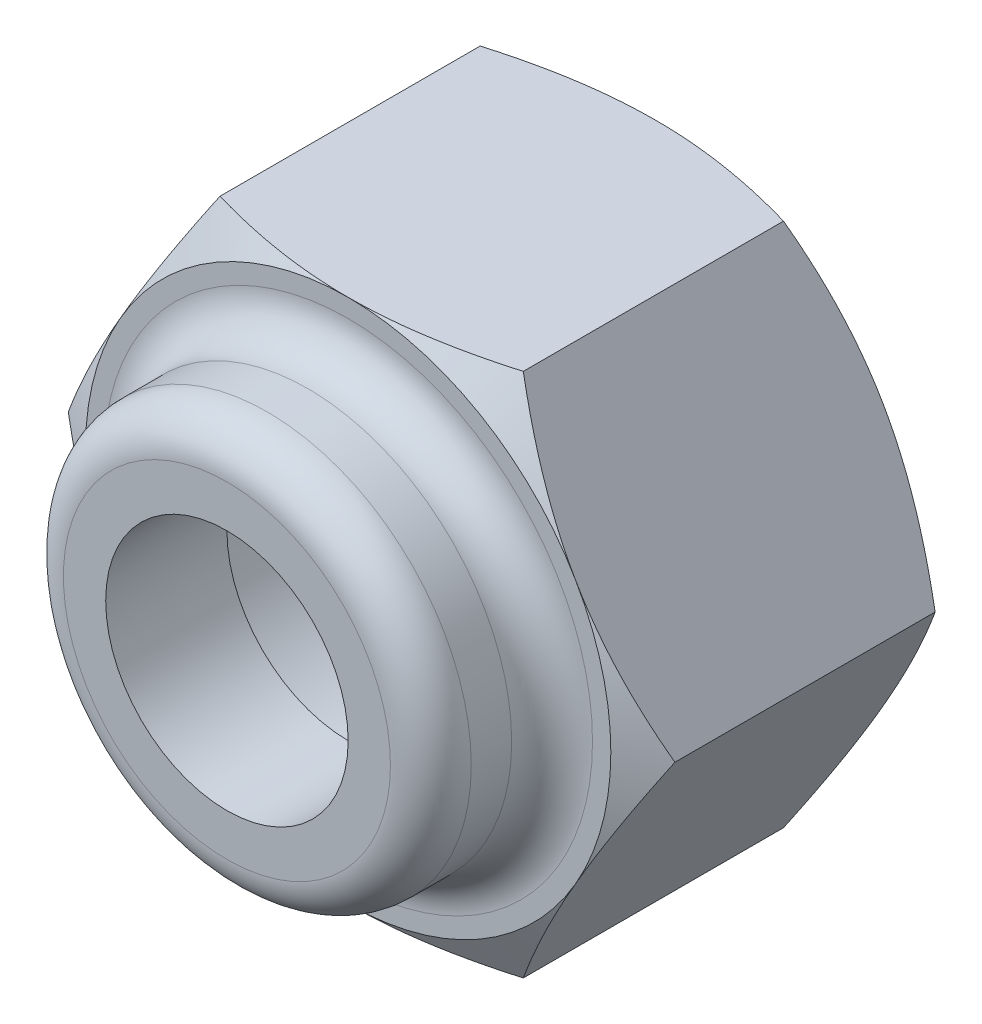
ISO-10303-21;
HEADER;
FILE_DESCRIPTION(('STEP AP214'),'2;1');
FILE_NAME('part.step','',(''),(''),'','','');
FILE_SCHEMA(('AUTOMOTIVE_DESIGN { 1 0 10303 214 1 1 1 1 }'));
ENDSEC;
DATA;
#1=APPLICATION_CONTEXT('core data for automotive mechanical design processes');
#2=APPLICATION_PROTOCOL_DEFINITION('international standard','automotive_design',2000,#1);
#3=PRODUCT_CONTEXT('',#1,'mechanical');
#4=PRODUCT('Part','Part','',(#3));
#5=PRODUCT_RELATED_PRODUCT_CATEGORY('part','',(#4));
#6=PRODUCT_DEFINITION_FORMATION('','',#4);
#7=PRODUCT_DEFINITION_CONTEXT('part definition',#1,'design');
#8=PRODUCT_DEFINITION('design','',#6,#7);
#9=PRODUCT_DEFINITION_SHAPE('','',#8);
#10=(LENGTH_UNIT() NAMED_UNIT(*) SI_UNIT(.MILLI.,.METRE.));
#11=(NAMED_UNIT(*) PLANE_ANGLE_UNIT() SI_UNIT($,.RADIAN.));
#12=(NAMED_UNIT(*) SI_UNIT($,.STERADIAN.) SOLID_ANGLE_UNIT());
#13=UNCERTAINTY_MEASURE_WITH_UNIT(LENGTH_MEASURE(1.E-05),#10,'distance_accuracy_value','');
#14=(GEOMETRIC_REPRESENTATION_CONTEXT(3) GLOBAL_UNCERTAINTY_ASSIGNED_CONTEXT((#13)) GLOBAL_UNIT_ASSIGNED_CONTEXT((#10,
#11,#12)) REPRESENTATION_CONTEXT('',''));
#15=CARTESIAN_POINT('',(0.,0.,0.));
#16=DIRECTION('',(0.,0.,1.));
#17=DIRECTION('',(1.,0.,0.));
#18=AXIS2_PLACEMENT_3D('',#15,#16,#17);
#19=CARTESIAN_POINT('',(-11.2583302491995,-6.49999999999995,7.60000000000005));
#20=DIRECTION('',(0.,0.,1.));
#21=DIRECTION('',(1.,0.,0.));
#22=AXIS2_PLACEMENT_3D('',#19,#20,#21);
#23=PLANE('',#22);
#24=CARTESIAN_POINT('',(0.,0.,7.60000000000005));
#25=DIRECTION('',(0.,0.,1.));
#26=DIRECTION('',(1.,0.,0.));
#27=AXIS2_PLACEMENT_3D('',#24,#25,#26);
#28=CIRCLE('',#27,6.04612896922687);
#29=CARTESIAN_POINT('',(6.04612896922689,0.,7.60000000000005));
#30=VERTEX_POINT('',#29);
#31=EDGE_CURVE('E11',#30,#30,#28,.F.);
#32=ORIENTED_EDGE('',*,*,#31,.T.);
#33=EDGE_LOOP('',(#32));
#34=FACE_BOUND('',#33,.T.);
#35=CARTESIAN_POINT('',(0.,0.,7.60000000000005));
#36=DIRECTION('',(0.,0.,1.));
#37=DIRECTION('',(1.,0.,0.));
#38=AXIS2_PLACEMENT_3D('',#35,#36,#37);
#39=CIRCLE('',#38,6.5);
#40=CARTESIAN_POINT('',(5.62916512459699,-3.25000000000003,7.60000000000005));
#41=VERTEX_POINT('',#40);
#42=CARTESIAN_POINT('',(5.62916512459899,3.25000000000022,7.60000000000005));
#43=VERTEX_POINT('',#42);
#44=EDGE_CURVE('E138',#41,#43,#39,.T.);
#45=ORIENTED_EDGE('',*,*,#44,.T.);
#46=CARTESIAN_POINT('',(0.,0.,7.60000000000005));
#47=DIRECTION('',(0.,0.,1.));
#48=DIRECTION('',(1.,0.,0.));
#49=AXIS2_PLACEMENT_3D('',#46,#47,#48);
#50=CIRCLE('',#49,6.5);
#51=CARTESIAN_POINT('',(0.,6.50000000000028,7.60000000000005));
#52=VERTEX_POINT('',#51);
#53=EDGE_CURVE('E47',#43,#52,#50,.T.);
#54=ORIENTED_EDGE('',*,*,#53,.T.);
#55=CARTESIAN_POINT('',(-5.62916512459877,3.25,7.60000000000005));
#56=VERTEX_POINT('',#55);
#57=EDGE_CURVE('E127',#52,#56,#39,.T.);
#58=ORIENTED_EDGE('',*,*,#57,.T.);
#59=CARTESIAN_POINT('',(-5.62916512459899,-3.24999999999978,7.60000000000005));
#60=VERTEX_POINT('',#59);
#61=EDGE_CURVE('E136',#56,#60,#39,.T.);
#62=ORIENTED_EDGE('',*,*,#61,.T.);
#63=CARTESIAN_POINT('',(0.,-6.50000000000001,7.60000000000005));
#64=VERTEX_POINT('',#63);
#65=EDGE_CURVE('E404',#60,#64,#39,.T.);
#66=ORIENTED_EDGE('',*,*,#65,.T.);
#67=EDGE_CURVE('E252',#64,#41,#39,.T.);
#68=ORIENTED_EDGE('',*,*,#67,.T.);
#69=EDGE_LOOP('',(#45,#54,#58,#62,#66,#68));
#70=FACE_BOUND('',#69,.T.);
#71=ADVANCED_FACE('F31',(#34,#70),#23,.T.);
#72=CARTESIAN_POINT('',(-7.50555349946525,0.,7.60000000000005));
#73=DIRECTION('',(-0.866025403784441,0.500000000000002,0.));
#74=DIRECTION('',(-0.500000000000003,-0.866025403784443,0.));
#75=AXIS2_PLACEMENT_3D('',#72,#73,#74);
#76=PLANE('',#75);
#77=DIRECTION('',(0.,0.,-1.));
#78=VECTOR('',#77,1.);
#79=CARTESIAN_POINT('',(-7.50555349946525,0.,7.60000000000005));
#80=LINE('',#79,#78);
#81=CARTESIAN_POINT('',(-7.50555349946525,0.,7.01944341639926));
#82=VERTEX_POINT('',#81);
#83=CARTESIAN_POINT('',(-7.50555349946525,0.,0.580556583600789));
#84=VERTEX_POINT('',#83);
#85=EDGE_CURVE('E235',#82,#84,#80,.T.);
#86=ORIENTED_EDGE('',*,*,#85,.F.);
#87=CARTESIAN_POINT('',(-7.50566896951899,-0.000199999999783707,7.01937674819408));
#88=CARTESIAN_POINT('',(-7.42317863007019,0.142677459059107,7.06699557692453));
#89=CARTESIAN_POINT('',(-7.34038072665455,0.286087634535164,7.11245329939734));
#90=CARTESIAN_POINT('',(-7.17411251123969,0.574072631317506,7.19845131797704));
#91=CARTESIAN_POINT('',(-7.09064192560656,0.718647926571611,7.23898949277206));
#92=CARTESIAN_POINT('',(-6.83889369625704,1.15468865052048,7.35242899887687));
#93=CARTESIAN_POINT('',(-6.66962231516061,1.44787528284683,7.41695219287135));
#94=CARTESIAN_POINT('',(-6.41631077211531,1.88662374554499,7.49261341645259));
#95=CARTESIAN_POINT('',(-6.3330274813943,2.03087463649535,7.51416714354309));
#96=CARTESIAN_POINT('',(-6.16608458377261,2.32002821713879,7.55030968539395));
#97=CARTESIAN_POINT('',(-6.08242501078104,2.46493084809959,7.56489911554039));
#98=CARTESIAN_POINT('',(-5.91496056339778,2.75498777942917,7.58674124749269));
#99=CARTESIAN_POINT('',(-5.8311559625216,2.9001416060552,7.59400227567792));
#100=CARTESIAN_POINT('',(-5.66347396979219,3.19057533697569,7.60103969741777));
#101=CARTESIAN_POINT('',(-5.57959658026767,3.33585523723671,7.60081632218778));
#102=CARTESIAN_POINT('',(-5.34979921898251,3.73387594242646,7.58991654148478));
#103=CARTESIAN_POINT('',(-5.20395446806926,3.98648646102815,7.57161818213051));
#104=CARTESIAN_POINT('',(-4.91323365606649,4.49002967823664,7.51359365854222));
#105=CARTESIAN_POINT('',(-4.76835861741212,4.7409606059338,7.47384766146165));
#106=CARTESIAN_POINT('',(-4.477052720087,5.24551722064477,7.37449409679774));
#107=CARTESIAN_POINT('',(-4.33065861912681,5.49907924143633,7.31446557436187));
#108=CARTESIAN_POINT('',(-4.04005357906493,6.00242193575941,7.17822500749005));
#109=CARTESIAN_POINT('',(-3.89583891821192,6.25220905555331,7.10204496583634));
#110=CARTESIAN_POINT('',(-3.75266127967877,6.50020000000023,7.01937674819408));
#111=B_SPLINE_CURVE_WITH_KNOTS('',3,(#87,#88,#89,#90,#91,#92,#93,#94,#95,#96,#97,#98,#99,#100,
#101,#102,#103,#104,#105,#106,#107,#108,#109,#110),.UNSPECIFIED.,.F.,.F.,(4,2,2,2,2,2,2,2,2,2,2,
4),(0.,0.515105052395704,1.03043143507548,2.06322554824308,2.56697389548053,3.07067772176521,
3.57380860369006,4.07692394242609,4.95279354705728,5.82947446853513,6.72559912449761,
7.61996451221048),.UNSPECIFIED.);
#112=EDGE_CURVE('E283',#82,#56,#111,.T.);
#113=ORIENTED_EDGE('',*,*,#112,.T.);
#114=CARTESIAN_POINT('',(-3.75277674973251,6.50000000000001,7.01944341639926));
#115=VERTEX_POINT('',#114);
#116=EDGE_CURVE('E130',#56,#115,#111,.T.);
#117=ORIENTED_EDGE('',*,*,#116,.T.);
#118=DIRECTION('',(0.,0.,-1.));
#119=VECTOR('',#118,1.);
#120=CARTESIAN_POINT('',(-3.75277674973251,6.50000000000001,7.60000000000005));
#121=LINE('',#120,#119);
#122=CARTESIAN_POINT('',(-3.75277674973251,6.50000000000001,0.580556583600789));
#123=VERTEX_POINT('',#122);
#124=EDGE_CURVE('E147',#115,#123,#121,.T.);
#125=ORIENTED_EDGE('',*,*,#124,.T.);
#126=CARTESIAN_POINT('',(-3.75266127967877,6.50020000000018,0.580623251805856));
#127=CARTESIAN_POINT('',(-3.83515161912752,6.3573225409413,0.533004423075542));
#128=CARTESIAN_POINT('',(-3.91794952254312,6.21391236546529,0.487546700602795));
#129=CARTESIAN_POINT('',(-4.08421773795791,5.92592736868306,0.401548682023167));
#130=CARTESIAN_POINT('',(-4.167688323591,5.78135207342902,0.361010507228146));
#131=CARTESIAN_POINT('',(-4.41943655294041,5.34531134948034,0.247571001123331));
#132=CARTESIAN_POINT('',(-4.58870793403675,5.0521247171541,0.183047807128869));
#133=CARTESIAN_POINT('',(-4.84201947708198,4.61337625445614,0.107386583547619));
#134=CARTESIAN_POINT('',(-4.92530276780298,4.46912536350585,0.0858328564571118));
#135=CARTESIAN_POINT('',(-5.09224566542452,4.17997178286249,0.0496903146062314));
#136=CARTESIAN_POINT('',(-5.17590523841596,4.03506915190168,0.0351008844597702));
#137=CARTESIAN_POINT('',(-5.34336968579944,3.74501222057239,0.0132587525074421));
#138=CARTESIAN_POINT('',(-5.42717428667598,3.59985839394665,0.00599772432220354));
#139=CARTESIAN_POINT('',(-5.59485627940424,3.30942466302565,-0.00103969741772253));
#140=CARTESIAN_POINT('',(-5.67873366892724,3.16414476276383,-0.000816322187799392));
#141=CARTESIAN_POINT('',(-5.9085310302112,2.76612405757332,0.0100834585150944));
#142=CARTESIAN_POINT('',(-6.05437578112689,2.51351353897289,0.0283818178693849));
#143=CARTESIAN_POINT('',(-6.34509659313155,2.00997032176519,0.0864063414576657));
#144=CARTESIAN_POINT('',(-6.48997163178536,1.75903939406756,0.126152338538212));
#145=CARTESIAN_POINT('',(-6.7812775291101,1.25448277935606,0.225505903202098));
#146=CARTESIAN_POINT('',(-6.92767163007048,1.00092075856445,0.285534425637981));
#147=CARTESIAN_POINT('',(-7.21827667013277,0.497578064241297,0.42177499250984));
#148=CARTESIAN_POINT('',(-7.36249133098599,0.247790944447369,0.497955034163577));
#149=CARTESIAN_POINT('',(-7.50566896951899,-0.000199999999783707,0.580623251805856));
#150=B_SPLINE_CURVE_WITH_KNOTS('',3,(#126,#127,#128,#129,#130,#131,#132,#133,#134,#135,#136,
#137,#138,#139,#140,#141,#142,#143,#144,#145,#146,#147,#148,#149),.UNSPECIFIED.,.F.,.F.,(4,2,2,
2,2,2,2,2,2,2,2,4),(0.,0.515105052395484,1.03043143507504,2.06322554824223,2.56697389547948,
3.07067772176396,3.57380860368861,4.07692394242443,4.952793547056,5.82947446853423,
6.72559912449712,7.61996451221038),.UNSPECIFIED.);
#151=CARTESIAN_POINT('',(-5.62916512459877,3.25,0.));
#152=VERTEX_POINT('',#151);
#153=EDGE_CURVE('E231',#123,#152,#150,.T.);
#154=ORIENTED_EDGE('',*,*,#153,.T.);
#155=EDGE_CURVE('E225',#152,#84,#150,.T.);
#156=ORIENTED_EDGE('',*,*,#155,.T.);
#157=EDGE_LOOP('',(#86,#113,#117,#125,#154,#156));
#158=FACE_BOUND('',#157,.T.);
#159=ADVANCED_FACE('F33',(#158),#76,.T.);
#160=CARTESIAN_POINT('',(-3.75277674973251,-6.50000000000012,7.60000000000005));
#161=DIRECTION('',(-0.866025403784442,-0.500000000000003,0.));
#162=DIRECTION('',(0.500000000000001,-0.866025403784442,0.));
#163=AXIS2_PLACEMENT_3D('',#160,#161,#162);
#164=PLANE('',#163);
#165=DIRECTION('',(0.,0.,-1.));
#166=VECTOR('',#165,1.);
#167=CARTESIAN_POINT('',(-3.75277674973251,-6.50000000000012,7.60000000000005));
#168=LINE('',#167,#166);
#169=CARTESIAN_POINT('',(-3.75277674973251,-6.50000000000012,7.01944341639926));
#170=VERTEX_POINT('',#169);
#171=CARTESIAN_POINT('',(-3.75277674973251,-6.50000000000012,0.580556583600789));
#172=VERTEX_POINT('',#171);
#173=EDGE_CURVE('E238',#170,#172,#168,.T.);
#174=ORIENTED_EDGE('',*,*,#173,.F.);
#175=CARTESIAN_POINT('',(-3.75266127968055,-6.50019999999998,7.01937674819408));
#176=CARTESIAN_POINT('',(-3.83515161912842,-6.35732254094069,7.06699557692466));
#177=CARTESIAN_POINT('',(-3.91794952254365,-6.2139123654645,7.1124532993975));
#178=CARTESIAN_POINT('',(-4.08421773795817,-5.92592736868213,7.1984513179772));
#179=CARTESIAN_POINT('',(-4.16768832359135,-5.78135207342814,7.23898949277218));
#180=CARTESIAN_POINT('',(-4.41943655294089,-5.34531134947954,7.35242899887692));
#181=CARTESIAN_POINT('',(-4.58870793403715,-5.05212471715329,7.41695219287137));
#182=CARTESIAN_POINT('',(-4.84201947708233,-4.61337625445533,7.49261341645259));
#183=CARTESIAN_POINT('',(-4.92530276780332,-4.46912536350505,7.51416714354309));
#184=CARTESIAN_POINT('',(-5.09224566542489,-4.17997178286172,7.55030968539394));
#185=CARTESIAN_POINT('',(-5.17590523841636,-4.03506915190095,7.56489911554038));
#186=CARTESIAN_POINT('',(-5.34336968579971,-3.7450122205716,7.5867412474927));
#187=CARTESIAN_POINT('',(-5.42717428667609,-3.59985839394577,7.59400227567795));
#188=CARTESIAN_POINT('',(-5.59485627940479,-3.30942466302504,7.60103969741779));
#189=CARTESIAN_POINT('',(-5.67873366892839,-3.16414476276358,7.60081632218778));
#190=CARTESIAN_POINT('',(-5.90853103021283,-2.7661240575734,7.58991654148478));
#191=CARTESIAN_POINT('',(-6.05437578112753,-2.51351353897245,7.57161818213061));
#192=CARTESIAN_POINT('',(-6.34509659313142,-2.00997032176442,7.51359365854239));
#193=CARTESIAN_POINT('',(-6.48997163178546,-1.75903939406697,7.47384766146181));
#194=CARTESIAN_POINT('',(-6.78127752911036,-1.25448277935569,7.37449409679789));
#195=CARTESIAN_POINT('',(-6.92767163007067,-1.0009207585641,7.31446557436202));
#196=CARTESIAN_POINT('',(-7.21827667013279,-0.497578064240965,7.17822500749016));
#197=CARTESIAN_POINT('',(-7.36249133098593,-0.247790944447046,7.10204496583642));
#198=CARTESIAN_POINT('',(-7.50566896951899,0.000200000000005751,7.01937674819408));
#199=B_SPLINE_CURVE_WITH_KNOTS('',3,(#175,#176,#177,#178,#179,#180,#181,#182,#183,#184,#185,
#186,#187,#188,#189,#190,#191,#192,#193,#194,#195,#196,#197,#198),.UNSPECIFIED.,.F.,.F.,(4,2,2,
2,2,2,2,2,2,2,2,4),(0.,0.515105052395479,1.03043143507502,2.06322554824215,2.56697389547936,
3.07067772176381,3.57380860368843,4.07692394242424,4.95279354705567,5.82947446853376,
6.72559912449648,7.61996451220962),.UNSPECIFIED.);
#200=EDGE_CURVE('E194',#170,#60,#199,.T.);
#201=ORIENTED_EDGE('',*,*,#200,.T.);
#202=EDGE_CURVE('E188',#60,#82,#199,.T.);
#203=ORIENTED_EDGE('',*,*,#202,.T.);
#204=ORIENTED_EDGE('',*,*,#85,.T.);
#205=CARTESIAN_POINT('',(-7.50566896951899,0.000200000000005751,0.580623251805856));
#206=CARTESIAN_POINT('',(-7.4231786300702,-0.142677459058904,0.533004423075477));
#207=CARTESIAN_POINT('',(-7.34038072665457,-0.286087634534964,0.487546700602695));
#208=CARTESIAN_POINT('',(-7.17411251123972,-0.574072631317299,0.401548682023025));
#209=CARTESIAN_POINT('',(-7.0906419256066,-0.718647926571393,0.361010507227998));
#210=CARTESIAN_POINT('',(-6.83889369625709,-1.15468865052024,0.247571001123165));
#211=CARTESIAN_POINT('',(-6.66962231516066,-1.44787528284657,0.18304780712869));
#212=CARTESIAN_POINT('',(-6.41631077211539,-1.88662374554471,0.107386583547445));
#213=CARTESIAN_POINT('',(-6.33302748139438,-2.03087463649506,0.0858328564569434));
#214=CARTESIAN_POINT('',(-6.1660845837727,-2.32002821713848,0.0496903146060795));
#215=CARTESIAN_POINT('',(-6.08242501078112,-2.46493084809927,0.0351008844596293));
#216=CARTESIAN_POINT('',(-5.91496056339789,-2.75498777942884,0.0132587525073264));
#217=CARTESIAN_POINT('',(-5.83115596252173,-2.90014160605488,0.00599772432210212));
#218=CARTESIAN_POINT('',(-5.66347396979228,-3.19057533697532,-0.00103969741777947));
#219=CARTESIAN_POINT('',(-5.57959658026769,-3.33585523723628,-0.000816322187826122));
#220=CARTESIAN_POINT('',(-5.3497992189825,-3.73387594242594,0.0100834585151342));
#221=CARTESIAN_POINT('',(-5.20395446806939,-3.98648646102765,0.0283818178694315));
#222=CARTESIAN_POINT('',(-4.91323365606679,-4.4900296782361,0.0864063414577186));
#223=CARTESIAN_POINT('',(-4.76835861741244,-4.7409606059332,0.126152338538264));
#224=CARTESIAN_POINT('',(-4.47705272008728,-5.24551722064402,0.225505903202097));
#225=CARTESIAN_POINT('',(-4.33065861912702,-5.49907924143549,0.285534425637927));
#226=CARTESIAN_POINT('',(-4.04005357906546,-6.00242193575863,0.421774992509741));
#227=CARTESIAN_POINT('',(-3.89583891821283,-6.25220905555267,0.497955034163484));
#228=CARTESIAN_POINT('',(-3.75266127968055,-6.50019999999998,0.580623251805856));
#229=B_SPLINE_CURVE_WITH_KNOTS('',3,(#205,#206,#207,#208,#209,#210,#211,#212,#213,#214,#215,
#216,#217,#218,#219,#220,#221,#222,#223,#224,#225,#226,#227,#228),.UNSPECIFIED.,.F.,.F.,(4,2,2,
2,2,2,2,2,2,2,2,4),(0.,0.515105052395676,1.03043143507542,2.06322554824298,2.5669738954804,
3.07067772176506,3.57380860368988,4.07692394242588,4.95279354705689,5.82947446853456,
6.72559912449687,7.61996451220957),.UNSPECIFIED.);
#230=CARTESIAN_POINT('',(-5.62916512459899,-3.24999999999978,0.));
#231=VERTEX_POINT('',#230);
#232=EDGE_CURVE('E218',#84,#231,#229,.T.);
#233=ORIENTED_EDGE('',*,*,#232,.T.);
#234=EDGE_CURVE('E211',#231,#172,#229,.T.);
#235=ORIENTED_EDGE('',*,*,#234,.T.);
#236=EDGE_LOOP('',(#174,#201,#203,#204,#233,#235));
#237=FACE_BOUND('',#236,.T.);
#238=ADVANCED_FACE('F201',(#237),#164,.T.);
#239=CARTESIAN_POINT('',(3.75277674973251,-6.49999999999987,7.60000000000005));
#240=DIRECTION('',(0.,-1.,0.));
#241=DIRECTION('',(1.,0.,0.));
#242=AXIS2_PLACEMENT_3D('',#239,#240,#241);
#243=PLANE('',#242);
#244=DIRECTION('',(0.,0.,-1.));
#245=VECTOR('',#244,1.);
#246=CARTESIAN_POINT('',(3.75277674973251,-6.49999999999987,7.60000000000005));
#247=LINE('',#246,#245);
#248=CARTESIAN_POINT('',(3.75277674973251,-6.49999999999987,7.01944341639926));
#249=VERTEX_POINT('',#248);
#250=CARTESIAN_POINT('',(3.75277674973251,-6.49999999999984,0.580556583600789));
#251=VERTEX_POINT('',#250);
#252=EDGE_CURVE('E240',#249,#251,#247,.T.);
#253=ORIENTED_EDGE('',*,*,#252,.F.);
#254=CARTESIAN_POINT('',(-9.9772907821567,-6.49999999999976,4.47778992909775));
#255=CARTESIAN_POINT('',(-9.69424196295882,-6.49999999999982,4.614676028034));
#256=CARTESIAN_POINT('',(-9.41053219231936,-6.49999999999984,4.7502194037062));
#257=CARTESIAN_POINT('',(-8.84143883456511,-6.49999999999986,5.01786337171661));
#258=CARTESIAN_POINT('',(-8.55605498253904,-6.49999999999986,5.14996340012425));
#259=CARTESIAN_POINT('',(-7.98174100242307,-6.49999999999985,5.41065019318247));
#260=CARTESIAN_POINT('',(-7.69279995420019,-6.49999999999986,5.53921298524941));
#261=CARTESIAN_POINT('',(-7.11258334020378,-6.49999999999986,5.79093759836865));
#262=CARTESIAN_POINT('',(-6.82130788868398,-6.49999999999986,5.9140996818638));
#263=CARTESIAN_POINT('',(-6.22696298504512,-6.49999999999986,6.15727415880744));
#264=CARTESIAN_POINT('',(-5.92380598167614,-6.49999999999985,6.27707377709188));
#265=CARTESIAN_POINT('',(-5.31390808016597,-6.49999999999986,6.507353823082));
#266=CARTESIAN_POINT('',(-5.00716677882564,-6.49999999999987,6.6178331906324));
#267=CARTESIAN_POINT('',(-4.39021687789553,-6.49999999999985,6.82649614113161));
#268=CARTESIAN_POINT('',(-4.08001710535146,-6.49999999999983,6.92470553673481));
#269=CARTESIAN_POINT('',(-3.45518117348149,-6.49999999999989,7.10561092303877));
#270=CARTESIAN_POINT('',(-3.1405464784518,-6.49999999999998,7.18831191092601));
#271=CARTESIAN_POINT('',(-2.50833584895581,-6.49999999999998,7.33372427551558));
#272=CARTESIAN_POINT('',(-2.19078462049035,-6.49999999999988,7.39654012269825));
#273=CARTESIAN_POINT('',(-1.71165005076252,-6.49999999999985,7.47308014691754));
#274=CARTESIAN_POINT('',(-1.55145779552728,-6.49999999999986,7.49564728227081));
#275=CARTESIAN_POINT('',(-1.23031334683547,-6.49999999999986,7.53444204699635));
#276=CARTESIAN_POINT('',(-1.0693612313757,-6.49999999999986,7.55067031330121));
#277=CARTESIAN_POINT('',(-0.748968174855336,-6.49999999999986,7.57626594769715));
#278=CARTESIAN_POINT('',(-0.589534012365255,-6.49999999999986,7.5857178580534));
#279=CARTESIAN_POINT('',(-0.270409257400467,-6.49999999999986,7.5978788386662));
#280=CARTESIAN_POINT('',(-0.110718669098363,-6.49999999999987,7.60058801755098));
#281=CARTESIAN_POINT('',(0.208634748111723,-6.49999999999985,7.5991990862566));
#282=CARTESIAN_POINT('',(0.368297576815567,-6.49999999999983,7.59510092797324));
#283=CARTESIAN_POINT('',(0.687311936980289,-6.4999999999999,7.58019557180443));
#284=CARTESIAN_POINT('',(0.846663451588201,-6.49999999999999,7.56938802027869));
#285=CARTESIAN_POINT('',(1.23282228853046,-6.50000000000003,7.53529329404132));
#286=CARTESIAN_POINT('',(1.45933886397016,-6.49999999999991,7.50864596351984));
#287=CARTESIAN_POINT('',(1.91061150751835,-6.49999999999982,7.44327257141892));
#288=CARTESIAN_POINT('',(2.13536731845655,-6.49999999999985,7.40454477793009));
#289=CARTESIAN_POINT('',(2.80678176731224,-6.4999999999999,7.27230120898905));
#290=CARTESIAN_POINT('',(3.25031976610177,-6.49999999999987,7.16275192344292));
#291=CARTESIAN_POINT('',(3.91338278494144,-6.49999999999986,6.97379149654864));
#292=CARTESIAN_POINT('',(4.13637192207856,-6.49999999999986,6.90584530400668));
#293=CARTESIAN_POINT('',(4.58018302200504,-6.49999999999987,6.76314671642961));
#294=CARTESIAN_POINT('',(4.80100497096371,-6.49999999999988,6.68839427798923));
#295=CARTESIAN_POINT('',(5.24055596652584,-6.49999999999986,6.53326153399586));
#296=CARTESIAN_POINT('',(5.45928573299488,-6.49999999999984,6.45288324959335));
#297=CARTESIAN_POINT('',(5.89495024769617,-6.4999999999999,6.28741937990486));
#298=CARTESIAN_POINT('',(6.11188501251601,-6.49999999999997,6.20233383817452));
#299=CARTESIAN_POINT('',(6.60444885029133,-6.49999999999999,6.00396155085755));
#300=CARTESIAN_POINT('',(6.8795745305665,-6.4999999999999,5.88942755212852));
#301=CARTESIAN_POINT('',(7.42764194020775,-6.49999999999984,5.65523525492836));
#302=CARTESIAN_POINT('',(7.7005835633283,-6.49999999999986,5.5355767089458));
#303=CARTESIAN_POINT('',(8.24466177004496,-6.49999999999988,5.29211434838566));
#304=CARTESIAN_POINT('',(8.51579804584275,-6.49999999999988,5.16830984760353));
#305=CARTESIAN_POINT('',(9.05651181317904,-6.49999999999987,4.91733776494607));
#306=CARTESIAN_POINT('',(9.32608927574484,-6.49999999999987,4.79017012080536));
#307=CARTESIAN_POINT('',(10.1333173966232,-6.49999999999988,4.40433583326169));
#308=CARTESIAN_POINT('',(10.6689977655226,-6.49999999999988,4.14154902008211));
#309=CARTESIAN_POINT('',(11.7365775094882,-6.49999999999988,3.6084057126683));
#310=CARTESIAN_POINT('',(12.2684767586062,-6.49999999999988,3.33804896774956));
#311=CARTESIAN_POINT('',(13.0435391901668,-6.49999999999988,2.93906244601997));
#312=CARTESIAN_POINT('',(13.2878118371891,-6.49999999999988,2.81258160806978));
#313=CARTESIAN_POINT('',(13.7758255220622,-6.49999999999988,2.5586084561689));
#314=CARTESIAN_POINT('',(14.0195665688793,-6.49999999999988,2.43111615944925));
#315=CARTESIAN_POINT('',(14.7501146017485,-6.49999999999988,2.04731206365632));
#316=CARTESIAN_POINT('',(15.2362291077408,-6.49999999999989,1.78968202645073));
#317=CARTESIAN_POINT('',(16.2059474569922,-6.49999999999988,1.27229349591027));
#318=CARTESIAN_POINT('',(16.6895544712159,-6.49999999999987,1.01254093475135));
#319=CARTESIAN_POINT('',(17.6555855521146,-6.4999999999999,0.490900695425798));
#320=CARTESIAN_POINT('',(18.1380096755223,-6.49999999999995,0.229013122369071));
#321=CARTESIAN_POINT('',(18.619992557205,-6.50000000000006,-0.0336789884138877));
#322=B_SPLINE_CURVE_WITH_KNOTS('',3,(#254,#255,#256,#257,#258,#259,#260,#261,#262,#263,#264,
#265,#266,#267,#268,#269,#270,#271,#272,#273,#274,#275,#276,#277,#278,#279,#280,#281,#282,#283,
#284,#285,#286,#287,#288,#289,#290,#291,#292,#293,#294,#295,#296,#297,#298,#299,#300,#301,#302,
#303,#304,#305,#306,#307,#308,#309,#310,#311,#312,#313,#314,#315,#316,#317,#318,#319,#320,#321),
.UNSPECIFIED.,.F.,.F.,(4,2,2,2,2,2,2,2,2,2,2,2,2,2,2,2,2,2,2,2,2,2,2,2,2,2,2,2,2,2,2,2,2,4),(0.,
0.943245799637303,1.88664511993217,2.83535686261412,3.78402245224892,4.76181213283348,
5.7397128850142,6.71552046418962,7.69101307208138,8.66129224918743,9.14650857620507,
9.63167613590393,10.1106800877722,10.5896763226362,11.0686759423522,11.547700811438,
12.2315479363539,12.9154931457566,14.2841869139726,14.9834656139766,15.6827487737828,
16.3817819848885,17.0808087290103,17.9747819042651,18.8687983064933,19.7629634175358,
20.6571450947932,22.447043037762,24.2370003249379,25.0622248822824,25.8874354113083,
27.5379151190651,29.1847624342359,30.8315291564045),.UNSPECIFIED.);
#323=EDGE_CURVE('E299',#249,#64,#322,.F.);
#324=ORIENTED_EDGE('',*,*,#323,.T.);
#325=EDGE_CURVE('E195',#64,#170,#322,.F.);
#326=ORIENTED_EDGE('',*,*,#325,.T.);
#327=ORIENTED_EDGE('',*,*,#173,.T.);
#328=CARTESIAN_POINT('',(-9.97058141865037,-6.49999999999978,3.11896475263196));
#329=CARTESIAN_POINT('',(-9.68505665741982,-6.49999999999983,2.98091016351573));
#330=CARTESIAN_POINT('',(-9.39885881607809,-6.49999999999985,2.84422254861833));
#331=CARTESIAN_POINT('',(-8.82475313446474,-6.49999999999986,2.57436199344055));
#332=CARTESIAN_POINT('',(-8.53684501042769,-6.49999999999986,2.44118965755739));
#333=CARTESIAN_POINT('',(-7.9574083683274,-6.49999999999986,2.17844267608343));
#334=CARTESIAN_POINT('',(-7.66586857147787,-6.49999999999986,2.04889281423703));
#335=CARTESIAN_POINT('',(-7.08039928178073,-6.49999999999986,1.79533218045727));
#336=CARTESIAN_POINT('',(-6.78646991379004,-6.49999999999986,1.67132112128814));
#337=CARTESIAN_POINT('',(-6.19202314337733,-6.49999999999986,1.42880427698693));
#338=CARTESIAN_POINT('',(-5.89146936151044,-6.49999999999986,1.31038717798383));
#339=CARTESIAN_POINT('',(-5.28682280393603,-6.49999999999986,1.08278341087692));
#340=CARTESIAN_POINT('',(-4.98272963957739,-6.49999999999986,0.973597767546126));
#341=CARTESIAN_POINT('',(-4.37114030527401,-6.49999999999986,0.767377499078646));
#342=CARTESIAN_POINT('',(-4.06365288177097,-6.49999999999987,0.670317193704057));
#343=CARTESIAN_POINT('',(-3.44430270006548,-6.49999999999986,0.491489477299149));
#344=CARTESIAN_POINT('',(-3.13244135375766,-6.49999999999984,0.409717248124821));
#345=CARTESIAN_POINT('',(-2.50415266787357,-6.49999999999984,0.265421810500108));
#346=CARTESIAN_POINT('',(-2.18772435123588,-6.49999999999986,0.202902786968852));
#347=CARTESIAN_POINT('',(-1.55098857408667,-6.49999999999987,0.101323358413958));
#348=CARTESIAN_POINT('',(-1.23068111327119,-6.49999999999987,0.0622629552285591));
#349=CARTESIAN_POINT('',(-0.749699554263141,-6.49999999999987,0.0237698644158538));
#350=CARTESIAN_POINT('',(-0.589789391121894,-6.49999999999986,0.0142870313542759));
#351=CARTESIAN_POINT('',(-0.269703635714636,-6.49999999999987,0.00209911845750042));
#352=CARTESIAN_POINT('',(-0.109528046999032,-6.49999999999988,-0.000606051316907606));
#353=CARTESIAN_POINT('',(0.210745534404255,-6.49999999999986,0.000833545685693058));
#354=CARTESIAN_POINT('',(0.370843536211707,-6.49999999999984,0.00497636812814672));
#355=CARTESIAN_POINT('',(0.690725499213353,-6.4999999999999,0.0200063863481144));
#356=CARTESIAN_POINT('',(0.850509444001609,-6.49999999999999,0.0308939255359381));
#357=CARTESIAN_POINT('',(1.23721068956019,-6.50000000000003,0.0651780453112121));
#358=CARTESIAN_POINT('',(1.46383600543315,-6.49999999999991,0.0919226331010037));
#359=CARTESIAN_POINT('',(1.9153620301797,-6.49999999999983,0.157500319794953));
#360=CARTESIAN_POINT('',(2.14026225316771,-6.49999999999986,0.196336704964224));
#361=CARTESIAN_POINT('',(2.5881484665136,-6.49999999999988,0.284720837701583));
#362=CARTESIAN_POINT('',(2.81113244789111,-6.49999999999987,0.334278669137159));
#363=CARTESIAN_POINT('',(3.25481181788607,-6.49999999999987,0.442592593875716));
#364=CARTESIAN_POINT('',(3.47550741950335,-6.49999999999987,0.501347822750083));
#365=CARTESIAN_POINT('',(3.92006995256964,-6.49999999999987,0.628192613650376));
#366=CARTESIAN_POINT('',(4.14388106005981,-6.49999999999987,0.696476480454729));
#367=CARTESIAN_POINT('',(4.58913797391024,-6.49999999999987,0.839828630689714));
#368=CARTESIAN_POINT('',(4.81058529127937,-6.49999999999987,0.91489224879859));
#369=CARTESIAN_POINT('',(5.2502263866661,-6.49999999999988,1.07025024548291));
#370=CARTESIAN_POINT('',(5.46843145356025,-6.49999999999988,1.1505128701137));
#371=CARTESIAN_POINT('',(5.90314543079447,-6.49999999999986,1.31577333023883));
#372=CARTESIAN_POINT('',(6.11965362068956,-6.49999999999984,1.40077306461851));
#373=CARTESIAN_POINT('',(6.33537360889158,-6.49999999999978,1.48767357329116));
#374=B_SPLINE_CURVE_WITH_KNOTS('',3,(#328,#329,#330,#331,#332,#333,#334,#335,#336,#337,#338,
#339,#340,#341,#342,#343,#344,#345,#346,#347,#348,#349,#350,#351,#352,#353,#354,#355,#356,#357,
#358,#359,#360,#361,#362,#363,#364,#365,#366,#367,#368,#369,#370,#371,#372,#373),.UNSPECIFIED.,
.F.,.F.,(4,2,2,2,2,2,2,2,2,2,2,2,2,2,2,2,2,2,2,2,2,2,4),(0.,0.95145953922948,1.90308161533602,
2.86011866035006,3.81710601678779,4.78611054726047,5.7552225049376,6.72224587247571,
7.68896396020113,8.65589202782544,9.62282017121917,10.1032714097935,10.5837162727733,
11.0640247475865,11.5443576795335,12.2285708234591,12.9129700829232,13.5980158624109,
14.28299729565,14.9848544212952,15.6862322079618,16.3836698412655,17.081389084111),.UNSPECIFIED.);
#375=CARTESIAN_POINT('',(0.,-6.50000000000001,0.));
#376=VERTEX_POINT('',#375);
#377=EDGE_CURVE('E219',#172,#376,#374,.T.);
#378=ORIENTED_EDGE('',*,*,#377,.T.);
#379=EDGE_CURVE('E220',#376,#251,#374,.T.);
#380=ORIENTED_EDGE('',*,*,#379,.T.);
#381=EDGE_LOOP('',(#253,#324,#326,#327,#378,#380));
#382=FACE_BOUND('',#381,.T.);
#383=ADVANCED_FACE('F205',(#382),#243,.T.);
#384=CARTESIAN_POINT('',(7.50555349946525,2.22044604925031E-13,7.60000000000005));
#385=DIRECTION('',(0.866025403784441,-0.500000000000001,0.));
#386=DIRECTION('',(0.500000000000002,0.866025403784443,0.));
#387=AXIS2_PLACEMENT_3D('',#384,#385,#386);
#388=PLANE('',#387);
#389=DIRECTION('',(0.,0.,-1.));
#390=VECTOR('',#389,1.);
#391=CARTESIAN_POINT('',(7.50555349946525,2.22044604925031E-13,7.60000000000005));
#392=LINE('',#391,#390);
#393=CARTESIAN_POINT('',(7.50555349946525,2.22044604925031E-13,7.01944341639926));
#394=VERTEX_POINT('',#393);
#395=CARTESIAN_POINT('',(7.50555349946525,2.22044604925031E-13,0.580556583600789));
#396=VERTEX_POINT('',#395);
#397=EDGE_CURVE('E242',#394,#396,#392,.T.);
#398=ORIENTED_EDGE('',*,*,#397,.F.);
#399=CARTESIAN_POINT('',(7.50566896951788,0.000200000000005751,7.01937674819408));
#400=CARTESIAN_POINT('',(7.42317863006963,-0.142677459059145,7.06699557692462));
#401=CARTESIAN_POINT('',(7.34038072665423,-0.2860876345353,7.11245329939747));
#402=CARTESIAN_POINT('',(7.17411251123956,-0.574072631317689,7.19845131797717));
#403=CARTESIAN_POINT('',(7.09064192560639,-0.718647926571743,7.23898949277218));
#404=CARTESIAN_POINT('',(6.83889369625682,-1.1546886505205,7.35242899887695));
#405=CARTESIAN_POINT('',(6.66962231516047,-1.44787528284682,7.41695219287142));
#406=CARTESIAN_POINT('',(6.41631077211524,-1.88662374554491,7.49261341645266));
#407=CARTESIAN_POINT('',(6.33302748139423,-2.03087463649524,7.51416714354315));
#408=CARTESIAN_POINT('',(6.16608458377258,-2.32002821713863,7.550309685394));
#409=CARTESIAN_POINT('',(6.08242501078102,-2.46493084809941,7.56489911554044));
#410=CARTESIAN_POINT('',(5.91496056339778,-2.75498777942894,7.58674124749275));
#411=CARTESIAN_POINT('',(5.83115596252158,-2.90014160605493,7.59400227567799));
#412=CARTESIAN_POINT('',(5.66347396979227,-3.19057533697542,7.60103969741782));
#413=CARTESIAN_POINT('',(5.57959658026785,-3.33585523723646,7.60081632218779));
#414=CARTESIAN_POINT('',(5.34979921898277,-3.73387594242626,7.58991654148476));
#415=CARTESIAN_POINT('',(5.20395446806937,-3.98648646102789,7.57161818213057));
#416=CARTESIAN_POINT('',(4.91323365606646,-4.49002967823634,7.51359365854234));
#417=CARTESIAN_POINT('',(4.76835861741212,-4.74096060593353,7.47384766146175));
#418=CARTESIAN_POINT('',(4.47705272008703,-5.24551722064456,7.37449409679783));
#419=CARTESIAN_POINT('',(4.33065861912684,-5.49907924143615,7.31446557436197));
#420=CARTESIAN_POINT('',(4.04005357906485,-6.00242193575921,7.17822500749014));
#421=CARTESIAN_POINT('',(3.89583891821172,-6.25220905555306,7.1020449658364));
#422=CARTESIAN_POINT('',(3.75266127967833,-6.50019999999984,7.01937674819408));
#423=B_SPLINE_CURVE_WITH_KNOTS('',3,(#399,#400,#401,#402,#403,#404,#405,#406,#407,#408,#409,
#410,#411,#412,#413,#414,#415,#416,#417,#418,#419,#420,#421,#422),.UNSPECIFIED.,.F.,.F.,(4,2,2,
2,2,2,2,2,2,2,2,4),(0.,0.515105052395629,1.03043143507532,2.06322554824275,2.56697389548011,
3.07067772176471,3.57380860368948,4.07692394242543,4.95279354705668,5.82947446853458,
6.72559912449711,7.61996451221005),.UNSPECIFIED.);
#424=EDGE_CURVE('E182',#394,#41,#423,.T.);
#425=ORIENTED_EDGE('',*,*,#424,.T.);
#426=EDGE_CURVE('E315',#41,#249,#423,.T.);
#427=ORIENTED_EDGE('',*,*,#426,.T.);
#428=ORIENTED_EDGE('',*,*,#252,.T.);
#429=CARTESIAN_POINT('',(3.75266127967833,-6.50019999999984,0.580623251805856));
#430=CARTESIAN_POINT('',(3.83515161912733,-6.35732254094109,0.533004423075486));
#431=CARTESIAN_POINT('',(3.91794952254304,-6.21391236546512,0.487546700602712));
#432=CARTESIAN_POINT('',(4.08421773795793,-5.92592736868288,0.401548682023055));
#433=CARTESIAN_POINT('',(4.16768832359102,-5.7813520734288,0.361010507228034));
#434=CARTESIAN_POINT('',(4.41943655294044,-5.34531134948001,0.247571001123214));
#435=CARTESIAN_POINT('',(4.58870793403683,-5.05212471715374,0.183047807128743));
#436=CARTESIAN_POINT('',(4.8420194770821,-4.6133762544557,0.107386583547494));
#437=CARTESIAN_POINT('',(4.92530276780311,-4.46912536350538,0.0858328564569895));
#438=CARTESIAN_POINT('',(5.0922456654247,-4.17997178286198,0.0496903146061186));
#439=CARTESIAN_POINT('',(5.17590523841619,-4.03506915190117,0.0351008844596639));
#440=CARTESIAN_POINT('',(5.3433696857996,-3.74501222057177,0.0132587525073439));
#441=CARTESIAN_POINT('',(5.42717428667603,-3.59985839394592,0.00599772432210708));
#442=CARTESIAN_POINT('',(5.59485627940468,-3.30942466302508,-0.00103969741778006));
#443=CARTESIAN_POINT('',(5.67873366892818,-3.16414476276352,-0.000816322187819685));
#444=CARTESIAN_POINT('',(5.90853103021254,-2.76612405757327,0.0100834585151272));
#445=CARTESIAN_POINT('',(6.05437578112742,-2.51351353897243,0.0283818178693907));
#446=CARTESIAN_POINT('',(6.34509659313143,-2.00997032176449,0.0864063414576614));
#447=CARTESIAN_POINT('',(6.48997163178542,-1.75903939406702,0.126152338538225));
#448=CARTESIAN_POINT('',(6.78127752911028,-1.25448277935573,0.225505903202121));
#449=CARTESIAN_POINT('',(6.9276716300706,-1.00092075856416,0.285534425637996));
#450=CARTESIAN_POINT('',(7.21827667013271,-0.497578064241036,0.421774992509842));
#451=CARTESIAN_POINT('',(7.36249133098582,-0.247790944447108,0.497955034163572));
#452=CARTESIAN_POINT('',(7.50566896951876,0.000200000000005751,0.580623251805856));
#453=B_SPLINE_CURVE_WITH_KNOTS('',3,(#429,#430,#431,#432,#433,#434,#435,#436,#437,#438,#439,
#440,#441,#442,#443,#444,#445,#446,#447,#448,#449,#450,#451,#452),.UNSPECIFIED.,.F.,.F.,(4,2,2,
2,2,2,2,2,2,2,2,4),(0.,0.515105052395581,1.03043143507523,2.0632255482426,2.56697389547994,
3.07067772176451,3.57380860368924,4.07692394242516,4.95279354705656,5.82947446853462,
6.72559912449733,7.61996451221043),.UNSPECIFIED.);
#454=CARTESIAN_POINT('',(5.62916512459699,-3.25,0.));
#455=VERTEX_POINT('',#454);
#456=EDGE_CURVE('E364',#251,#455,#453,.T.);
#457=ORIENTED_EDGE('',*,*,#456,.T.);
#458=EDGE_CURVE('E342',#455,#396,#453,.T.);
#459=ORIENTED_EDGE('',*,*,#458,.T.);
#460=EDGE_LOOP('',(#398,#425,#427,#428,#457,#459));
#461=FACE_BOUND('',#460,.T.);
#462=ADVANCED_FACE('F349',(#461),#388,.T.);
#463=CARTESIAN_POINT('',(3.75277674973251,6.50000000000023,7.60000000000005));
#464=DIRECTION('',(0.866025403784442,0.500000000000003,0.));
#465=DIRECTION('',(-0.500000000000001,0.866025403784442,0.));
#466=AXIS2_PLACEMENT_3D('',#463,#464,#465);
#467=PLANE('',#466);
#468=DIRECTION('',(0.,0.,-1.));
#469=VECTOR('',#468,1.);
#470=CARTESIAN_POINT('',(3.75277674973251,6.50000000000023,7.60000000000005));
#471=LINE('',#470,#469);
#472=CARTESIAN_POINT('',(3.75277674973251,6.50000000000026,7.01944341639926));
#473=VERTEX_POINT('',#472);
#474=CARTESIAN_POINT('',(3.75277674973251,6.50000000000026,0.580556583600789));
#475=VERTEX_POINT('',#474);
#476=EDGE_CURVE('E244',#473,#475,#471,.T.);
#477=ORIENTED_EDGE('',*,*,#476,.F.);
#478=CARTESIAN_POINT('',(3.75266127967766,6.50020000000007,7.01937674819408));
#479=CARTESIAN_POINT('',(3.83515161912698,6.35732254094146,7.06699557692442));
#480=CARTESIAN_POINT('',(3.91794952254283,6.21391236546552,7.11245329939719));
#481=CARTESIAN_POINT('',(4.08421773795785,5.92592736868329,7.19845131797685));
#482=CARTESIAN_POINT('',(4.16768832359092,5.78135207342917,7.23898949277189));
#483=CARTESIAN_POINT('',(4.41943655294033,5.34531134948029,7.35242899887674));
#484=CARTESIAN_POINT('',(4.58870793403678,5.05212471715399,7.41695219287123));
#485=CARTESIAN_POINT('',(4.84201947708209,4.61337625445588,7.49261341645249));
#486=CARTESIAN_POINT('',(4.9253027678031,4.46912536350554,7.514167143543));
#487=CARTESIAN_POINT('',(5.09224566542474,4.17997178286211,7.55030968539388));
#488=CARTESIAN_POINT('',(5.17590523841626,4.03506915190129,7.56489911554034));
#489=CARTESIAN_POINT('',(5.34336968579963,3.74501222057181,7.58674124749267));
#490=CARTESIAN_POINT('',(5.42717428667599,3.59985839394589,7.59400227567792));
#491=CARTESIAN_POINT('',(5.5948562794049,3.30942466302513,7.60103969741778));
#492=CARTESIAN_POINT('',(5.67873366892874,3.16414476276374,7.60081632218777));
#493=CARTESIAN_POINT('',(5.90853103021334,2.76612405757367,7.58991654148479));
#494=CARTESIAN_POINT('',(6.05437578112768,2.5135135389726,7.5716181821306));
#495=CARTESIAN_POINT('',(6.34509659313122,2.00997032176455,7.51359365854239));
#496=CARTESIAN_POINT('',(6.48997163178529,1.75903939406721,7.47384766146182));
#497=CARTESIAN_POINT('',(6.78127752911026,1.25448277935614,7.37449409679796));
#498=CARTESIAN_POINT('',(6.92767163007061,1.00092075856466,7.31446557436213));
#499=CARTESIAN_POINT('',(7.21827667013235,0.497578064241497,7.1782250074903));
#500=CARTESIAN_POINT('',(7.36249133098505,0.247790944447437,7.10204496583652));
#501=CARTESIAN_POINT('',(7.50566896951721,-0.000200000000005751,7.01937674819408));
#502=B_SPLINE_CURVE_WITH_KNOTS('',3,(#478,#479,#480,#481,#482,#483,#484,#485,#486,#487,#488,
#489,#490,#491,#492,#493,#494,#495,#496,#497,#498,#499,#500,#501),.UNSPECIFIED.,.F.,.F.,(4,2,2,
2,2,2,2,2,2,2,2,4),(0.,0.515105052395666,1.0304314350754,2.06322554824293,2.56697389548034,
3.07067772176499,3.5738086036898,4.0769239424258,4.952793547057,5.82947446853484,
6.72559912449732,7.61996451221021),.UNSPECIFIED.);
#503=EDGE_CURVE('E51',#473,#43,#502,.T.);
#504=ORIENTED_EDGE('',*,*,#503,.T.);
#505=EDGE_CURVE('E149',#43,#394,#502,.T.);
#506=ORIENTED_EDGE('',*,*,#505,.T.);
#507=ORIENTED_EDGE('',*,*,#397,.T.);
#508=CARTESIAN_POINT('',(7.50566896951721,-0.000200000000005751,0.580623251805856));
#509=CARTESIAN_POINT('',(7.42317863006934,0.142677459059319,0.533004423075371));
#510=CARTESIAN_POINT('',(7.34038072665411,0.286087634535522,0.487546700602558));
#511=CARTESIAN_POINT('',(7.17411251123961,0.574072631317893,0.401548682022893));
#512=CARTESIAN_POINT('',(7.09064192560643,0.718647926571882,0.361010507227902));
#513=CARTESIAN_POINT('',(6.83889369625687,1.15468865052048,0.247571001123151));
#514=CARTESIAN_POINT('',(6.66962231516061,1.44787528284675,0.183047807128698));
#515=CARTESIAN_POINT('',(6.41631077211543,1.88662374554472,0.107386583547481));
#516=CARTESIAN_POINT('',(6.33302748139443,2.030874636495,0.0858328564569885));
#517=CARTESIAN_POINT('',(6.16608458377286,2.32002821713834,0.0496903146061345));
#518=CARTESIAN_POINT('',(6.08242501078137,2.46493084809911,0.0351008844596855));
#519=CARTESIAN_POINT('',(5.91496056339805,2.75498777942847,0.0132587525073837));
#520=CARTESIAN_POINT('',(5.8311559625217,2.90014160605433,0.00599772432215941));
#521=CARTESIAN_POINT('',(5.66347396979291,3.190575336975,-0.00103969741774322));
#522=CARTESIAN_POINT('',(5.57959658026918,3.33585523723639,-0.000816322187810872));
#523=CARTESIAN_POINT('',(5.34979921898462,3.73387594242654,0.0100834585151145));
#524=CARTESIAN_POINT('',(5.20395446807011,3.98648646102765,0.0283818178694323));
#525=CARTESIAN_POINT('',(4.91323365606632,4.49002967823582,0.0864063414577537));
#526=CARTESIAN_POINT('',(4.76835861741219,4.74096060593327,0.126152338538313));
#527=CARTESIAN_POINT('',(4.47705272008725,5.24551722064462,0.225505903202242));
#528=CARTESIAN_POINT('',(4.33065861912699,5.49907924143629,0.285534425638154));
#529=CARTESIAN_POINT('',(4.04005357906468,6.00242193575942,0.421774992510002));
#530=CARTESIAN_POINT('',(3.89583891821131,6.25220905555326,0.497955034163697));
#531=CARTESIAN_POINT('',(3.75266127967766,6.50020000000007,0.580623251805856));
#532=B_SPLINE_CURVE_WITH_KNOTS('',3,(#508,#509,#510,#511,#512,#513,#514,#515,#516,#517,#518,
#519,#520,#521,#522,#523,#524,#525,#526,#527,#528,#529,#530,#531),.UNSPECIFIED.,.F.,.F.,(4,2,2,
2,2,2,2,2,2,2,2,4),(0.,0.515105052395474,1.03043143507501,2.06322554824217,2.5669738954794,
3.07067772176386,3.57380860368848,4.07692394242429,4.95279354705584,5.82947446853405,
6.72559912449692,7.61996451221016),.UNSPECIFIED.);
#533=CARTESIAN_POINT('',(5.62916512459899,3.25000000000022,0.));
#534=VERTEX_POINT('',#533);
#535=EDGE_CURVE('E336',#396,#534,#532,.T.);
#536=ORIENTED_EDGE('',*,*,#535,.T.);
#537=EDGE_CURVE('E335',#534,#475,#532,.T.);
#538=ORIENTED_EDGE('',*,*,#537,.T.);
#539=EDGE_LOOP('',(#477,#504,#506,#507,#536,#538));
#540=FACE_BOUND('',#539,.T.);
#541=ADVANCED_FACE('F346',(#540),#467,.T.);
#542=CARTESIAN_POINT('',(-3.75277674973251,6.50000000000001,7.60000000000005));
#543=DIRECTION('',(0.,1.,0.));
#544=DIRECTION('',(-1.,0.,0.));
#545=AXIS2_PLACEMENT_3D('',#542,#543,#544);
#546=PLANE('',#545);
#547=ORIENTED_EDGE('',*,*,#124,.F.);
#548=CARTESIAN_POINT('',(-9.9772926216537,6.4999999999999,4.47778903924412));
#549=CARTESIAN_POINT('',(-9.69424374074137,6.49999999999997,4.61467517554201));
#550=CARTESIAN_POINT('',(-9.41053390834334,6.5,4.7502185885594));
#551=CARTESIAN_POINT('',(-8.84144042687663,6.50000000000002,5.0178626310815));
#552=CARTESIAN_POINT('',(-8.55605651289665,6.50000000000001,5.14996269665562));
#553=CARTESIAN_POINT('',(-7.98174240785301,6.50000000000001,5.41064956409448));
#554=CARTESIAN_POINT('',(-7.69280129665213,6.50000000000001,5.53921239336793));
#555=CARTESIAN_POINT('',(-7.11258455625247,6.50000000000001,5.79093708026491));
#556=CARTESIAN_POINT('',(-6.82130904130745,6.50000000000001,5.91409920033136));
#557=CARTESIAN_POINT('',(-6.22696400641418,6.50000000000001,6.15727375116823));
#558=CARTESIAN_POINT('',(-5.92380693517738,6.50000000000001,6.27707340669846));
#559=CARTESIAN_POINT('',(-5.31390889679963,6.50000000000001,6.50735352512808));
#560=CARTESIAN_POINT('',(-5.00716752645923,6.5,6.61783292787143));
#561=CARTESIAN_POINT('',(-4.39021748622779,6.50000000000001,6.82649594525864));
#562=CARTESIAN_POINT('',(-4.08001764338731,6.50000000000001,6.92470537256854));
#563=CARTESIAN_POINT('',(-3.45518156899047,6.5,7.10561081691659));
#564=CARTESIAN_POINT('',(-3.14054680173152,6.49999999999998,7.1883118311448));
#565=CARTESIAN_POINT('',(-2.50833598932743,6.49999999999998,7.3337242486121));
#566=CARTESIAN_POINT('',(-2.19078464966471,6.5,7.39654012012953));
#567=CARTESIAN_POINT('',(-1.71164991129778,6.50000000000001,7.47308016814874));
#568=CARTESIAN_POINT('',(-1.5514575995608,6.5,7.49564730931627));
#569=CARTESIAN_POINT('',(-1.23031303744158,6.5,7.53444208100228));
#570=CARTESIAN_POINT('',(-1.06936086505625,6.5,7.55067034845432));
#571=CARTESIAN_POINT('',(-0.748967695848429,6.5,7.57626598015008));
#572=CARTESIAN_POINT('',(-0.589533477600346,6.5,7.58571788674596));
#573=CARTESIAN_POINT('',(-0.270408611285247,6.5,7.59787885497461));
#574=CARTESIAN_POINT('',(-0.110717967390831,6.5,7.60058802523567));
#575=CARTESIAN_POINT('',(0.208635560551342,6.5,7.59919907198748));
#576=CARTESIAN_POINT('',(0.368298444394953,6.50000000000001,7.59510090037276));
#577=CARTESIAN_POINT('',(0.687312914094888,6.5,7.58019551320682));
#578=CARTESIAN_POINT('',(0.846664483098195,6.49999999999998,7.5693879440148));
#579=CARTESIAN_POINT('',(1.23282340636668,6.49999999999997,7.53529317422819));
#580=CARTESIAN_POINT('',(1.45934001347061,6.49999999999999,7.50864581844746));
#581=CARTESIAN_POINT('',(1.91061271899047,6.50000000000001,7.44327237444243));
#582=CARTESIAN_POINT('',(2.13536856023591,6.5,7.40454455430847));
#583=CARTESIAN_POINT('',(2.8067830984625,6.5,7.27230090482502));
#584=CARTESIAN_POINT('',(3.25032115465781,6.5,7.16275156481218));
#585=CARTESIAN_POINT('',(3.91338425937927,6.5,6.97379105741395));
#586=CARTESIAN_POINT('',(4.13637342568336,6.49999999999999,6.90584483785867));
#587=CARTESIAN_POINT('',(4.58018458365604,6.5,6.76314619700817));
#588=CARTESIAN_POINT('',(4.80100656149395,6.50000000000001,6.68839373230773));
#589=CARTESIAN_POINT('',(5.24055761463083,6.49999999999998,6.53326093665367));
#590=CARTESIAN_POINT('',(5.45928740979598,6.49999999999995,6.45288262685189));
#591=CARTESIAN_POINT('',(5.894951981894,6.50000000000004,6.28741870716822));
#592=CARTESIAN_POINT('',(6.11188677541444,6.50000000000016,6.20233314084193));
#593=CARTESIAN_POINT('',(6.6044506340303,6.50000000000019,6.00396081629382));
#594=CARTESIAN_POINT('',(6.87957630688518,6.50000000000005,5.88942680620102));
#595=CARTESIAN_POINT('',(7.42764370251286,6.49999999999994,5.65523448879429));
#596=CARTESIAN_POINT('',(7.7005853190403,6.49999999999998,5.53557593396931));
#597=CARTESIAN_POINT('',(8.24466351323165,6.50000000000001,5.29211355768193));
#598=CARTESIAN_POINT('',(8.51579978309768,6.5,5.16830905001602));
#599=CARTESIAN_POINT('',(9.05651353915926,6.49999999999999,4.91733695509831));
#600=CARTESIAN_POINT('',(9.32609099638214,6.49999999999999,4.79016930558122));
#601=CARTESIAN_POINT('',(10.1333191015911,6.49999999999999,4.40433500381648));
#602=CARTESIAN_POINT('',(10.6689994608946,6.49999999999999,4.14154818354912));
#603=CARTESIAN_POINT('',(11.7365791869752,6.49999999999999,3.60840486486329));
#604=CARTESIAN_POINT('',(12.2684784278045,6.49999999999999,3.33804811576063));
#605=CARTESIAN_POINT('',(13.0435408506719,6.49999999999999,2.93906158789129));
#606=CARTESIAN_POINT('',(13.2878134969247,6.49999999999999,2.81258074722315));
#607=CARTESIAN_POINT('',(13.7758271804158,6.49999999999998,2.5586075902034));
#608=CARTESIAN_POINT('',(14.0195682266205,6.49999999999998,2.4311152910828));
#609=CARTESIAN_POINT('',(14.75011625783,6.49999999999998,2.0473111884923));
#610=CARTESIAN_POINT('',(15.2362307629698,6.49999999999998,1.78968114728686));
#611=CARTESIAN_POINT('',(16.2059491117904,6.49999999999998,1.27229260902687));
#612=CARTESIAN_POINT('',(16.6895561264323,6.49999999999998,1.01254004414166));
#613=CARTESIAN_POINT('',(17.6555872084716,6.49999999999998,0.490899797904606));
#614=CARTESIAN_POINT('',(18.1380113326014,6.49999999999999,0.229012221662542));
#615=CARTESIAN_POINT('',(18.6199942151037,6.50000000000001,-0.033679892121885));
#616=B_SPLINE_CURVE_WITH_KNOTS('',3,(#548,#549,#550,#551,#552,#553,#554,#555,#556,#557,#558,
#559,#560,#561,#562,#563,#564,#565,#566,#567,#568,#569,#570,#571,#572,#573,#574,#575,#576,#577,
#578,#579,#580,#581,#582,#583,#584,#585,#586,#587,#588,#589,#590,#591,#592,#593,#594,#595,#596,
#597,#598,#599,#600,#601,#602,#603,#604,#605,#606,#607,#608,#609,#610,#611,#612,#613,#614,#615),
.UNSPECIFIED.,.F.,.F.,(4,2,2,2,2,2,2,2,2,2,2,2,2,2,2,2,2,2,2,2,2,2,2,2,2,2,2,2,2,2,2,2,2,4),(0.,
0.943246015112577,1.88664555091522,2.83535751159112,3.7840233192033,4.76181323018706,
5.73971421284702,6.71552202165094,7.6910148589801,8.66129437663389,9.14651087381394,
9.63167860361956,10.1106827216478,10.5896791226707,11.0686789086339,11.5477039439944,
12.2315511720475,12.9154964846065,14.2841904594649,14.9834692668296,15.6827525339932,
16.3817858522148,17.0808127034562,17.97478587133,18.8688022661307,19.7629673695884,
20.6571490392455,22.447046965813,24.2370042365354,25.0622287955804,25.8874393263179,
27.5379190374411,29.1847663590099,30.8315330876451),.UNSPECIFIED.);
#617=EDGE_CURVE('E123',#115,#52,#616,.T.);
#618=ORIENTED_EDGE('',*,*,#617,.T.);
#619=EDGE_CURVE('E117',#52,#473,#616,.T.);
#620=ORIENTED_EDGE('',*,*,#619,.T.);
#621=ORIENTED_EDGE('',*,*,#476,.T.);
#622=CARTESIAN_POINT('',(-9.97058173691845,6.50000000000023,3.11896490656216));
#623=CARTESIAN_POINT('',(-9.6850569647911,6.50000000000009,2.98091031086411));
#624=CARTESIAN_POINT('',(-9.39885911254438,6.50000000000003,2.84422268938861));
#625=CARTESIAN_POINT('',(-8.82475340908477,6.49999999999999,2.57436212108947));
#626=CARTESIAN_POINT('',(-8.53684527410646,6.5,2.44118977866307));
#627=CARTESIAN_POINT('',(-7.95740860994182,6.50000000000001,2.17844278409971));
#628=CARTESIAN_POINT('',(-7.66586880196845,6.50000000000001,2.04889291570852));
#629=CARTESIAN_POINT('',(-7.08039948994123,6.5,1.79533226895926));
#630=CARTESIAN_POINT('',(-6.78647011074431,6.5,1.67132120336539));
#631=CARTESIAN_POINT('',(-6.19202331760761,6.5,1.42880434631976));
#632=CARTESIAN_POINT('',(-5.89146952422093,6.5,1.31038724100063));
#633=CARTESIAN_POINT('',(-5.28682294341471,6.5,1.08278346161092));
#634=CARTESIAN_POINT('',(-4.98272976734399,6.5,0.973597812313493));
#635=CARTESIAN_POINT('',(-4.37114040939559,6.5,0.767377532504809));
#636=CARTESIAN_POINT('',(-4.06365297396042,6.50000000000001,0.670317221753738));
#637=CARTESIAN_POINT('',(-3.44430276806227,6.49999999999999,0.491489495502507));
#638=CARTESIAN_POINT('',(-3.13244140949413,6.49999999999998,0.40971726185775));
#639=CARTESIAN_POINT('',(-2.5041526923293,6.49999999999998,0.2654218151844));
#640=CARTESIAN_POINT('',(-2.18772435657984,6.49999999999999,0.202902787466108));
#641=CARTESIAN_POINT('',(-1.5509885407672,6.50000000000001,0.101323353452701));
#642=CARTESIAN_POINT('',(-1.23068106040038,6.5,0.0622629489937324));
#643=CARTESIAN_POINT('',(-0.749699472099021,6.5,0.0237698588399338));
#644=CARTESIAN_POINT('',(-0.589789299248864,6.49999999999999,0.0142870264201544));
#645=CARTESIAN_POINT('',(-0.269703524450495,6.5,0.00209911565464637));
#646=CARTESIAN_POINT('',(-0.10952792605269,6.50000000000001,-0.000606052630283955));
#647=CARTESIAN_POINT('',(0.210745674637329,6.49999999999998,0.000833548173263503));
#648=CARTESIAN_POINT('',(0.370843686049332,6.49999999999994,0.00497637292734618));
#649=CARTESIAN_POINT('',(0.690725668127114,6.50000000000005,0.0200063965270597));
#650=CARTESIAN_POINT('',(0.850509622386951,6.5000000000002,0.0308939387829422));
#651=CARTESIAN_POINT('',(1.23721088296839,6.50000000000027,0.0651780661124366));
#652=CARTESIAN_POINT('',(1.46383620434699,6.50000000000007,0.0919226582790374));
#653=CARTESIAN_POINT('',(1.91536223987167,6.49999999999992,0.157500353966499));
#654=CARTESIAN_POINT('',(2.1402624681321,6.49999999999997,0.196336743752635));
#655=CARTESIAN_POINT('',(2.58814869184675,6.50000000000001,0.284720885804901));
#656=CARTESIAN_POINT('',(2.81113267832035,6.5,0.334278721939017));
#657=CARTESIAN_POINT('',(3.25481205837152,6.49999999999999,0.442592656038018));
#658=CARTESIAN_POINT('',(3.47550766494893,6.49999999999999,0.501347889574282));
#659=CARTESIAN_POINT('',(3.92007020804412,6.49999999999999,0.628192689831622));
#660=CARTESIAN_POINT('',(4.14388132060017,6.49999999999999,0.696476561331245));
#661=CARTESIAN_POINT('',(4.5891382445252,6.49999999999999,0.839828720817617));
#662=CARTESIAN_POINT('',(4.81058556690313,6.49999999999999,0.914892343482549));
#663=CARTESIAN_POINT('',(5.25022667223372,6.49999999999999,1.07025034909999));
#664=CARTESIAN_POINT('',(5.46843174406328,6.49999999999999,1.15051297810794));
#665=CARTESIAN_POINT('',(5.90314573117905,6.5,1.31577344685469));
#666=CARTESIAN_POINT('',(6.11965392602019,6.50000000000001,1.40077318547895));
#667=CARTESIAN_POINT('',(6.33537391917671,6.50000000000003,1.48767369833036));
#668=B_SPLINE_CURVE_WITH_KNOTS('',3,(#622,#623,#624,#625,#626,#627,#628,#629,#630,#631,#632,
#633,#634,#635,#636,#637,#638,#639,#640,#641,#642,#643,#644,#645,#646,#647,#648,#649,#650,#651,
#652,#653,#654,#655,#656,#657,#658,#659,#660,#661,#662,#663,#664,#665,#666,#667),.UNSPECIFIED.,
.F.,.F.,(4,2,2,2,2,2,2,2,2,2,2,2,2,2,2,2,2,2,2,2,2,2,4),(0.,0.951459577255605,1.90308169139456,
2.86011877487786,3.81710616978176,4.78611073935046,5.75522273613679,6.72224614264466,
7.68896426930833,8.6558923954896,9.62282059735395,10.1032718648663,10.5837167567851,
11.0640252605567,11.5443582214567,12.2285713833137,12.9129706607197,13.5980164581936,
14.2829979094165,14.9848550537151,15.6862328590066,16.3836705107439,17.0813897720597),.UNSPECIFIED.);
#669=CARTESIAN_POINT('',(0.,6.50000000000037,0.));
#670=VERTEX_POINT('',#669);
#671=EDGE_CURVE('E250',#475,#670,#668,.F.);
#672=ORIENTED_EDGE('',*,*,#671,.T.);
#673=EDGE_CURVE('E237',#670,#123,#668,.F.);
#674=ORIENTED_EDGE('',*,*,#673,.T.);
#675=EDGE_LOOP('',(#547,#618,#620,#621,#672,#674));
#676=FACE_BOUND('',#675,.T.);
#677=ADVANCED_FACE('F145',(#676),#546,.T.);
#678=CARTESIAN_POINT('',(-11.2583302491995,-6.49999999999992,0.));
#679=DIRECTION('',(0.,0.,1.));
#680=DIRECTION('',(1.,0.,0.));
#681=AXIS2_PLACEMENT_3D('',#678,#679,#680);
#682=PLANE('',#681);
#683=CARTESIAN_POINT('',(0.,0.,0.));
#684=DIRECTION('',(0.,0.,1.));
#685=DIRECTION('',(1.,0.,0.));
#686=AXIS2_PLACEMENT_3D('',#683,#684,#685);
#687=CIRCLE('',#686,4.);
#688=CARTESIAN_POINT('',(-4.00000000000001,0.,0.));
#689=VERTEX_POINT('',#688);
#690=EDGE_CURVE('E232',#689,#689,#687,.T.);
#691=ORIENTED_EDGE('',*,*,#690,.T.);
#692=EDGE_LOOP('',(#691));
#693=FACE_BOUND('',#692,.T.);
#694=CARTESIAN_POINT('',(0.,0.,0.));
#695=DIRECTION('',(0.,0.,-1.));
#696=DIRECTION('',(-1.,0.,0.));
#697=AXIS2_PLACEMENT_3D('',#694,#695,#696);
#698=CIRCLE('',#697,6.5);
#699=EDGE_CURVE('E334',#670,#534,#698,.T.);
#700=ORIENTED_EDGE('',*,*,#699,.T.);
#701=EDGE_CURVE('E338',#534,#455,#698,.T.);
#702=ORIENTED_EDGE('',*,*,#701,.T.);
#703=EDGE_CURVE('E368',#455,#376,#698,.T.);
#704=ORIENTED_EDGE('',*,*,#703,.T.);
#705=EDGE_CURVE('E298',#376,#231,#698,.T.);
#706=ORIENTED_EDGE('',*,*,#705,.T.);
#707=EDGE_CURVE('E294',#231,#152,#698,.T.);
#708=ORIENTED_EDGE('',*,*,#707,.T.);
#709=EDGE_CURVE('E300',#152,#670,#698,.T.);
#710=ORIENTED_EDGE('',*,*,#709,.T.);
#711=EDGE_LOOP('',(#700,#702,#704,#706,#708,#710));
#712=FACE_BOUND('',#711,.T.);
#713=ADVANCED_FACE('F332',(#693,#712),#682,.F.);
#714=CARTESIAN_POINT('',(0.,0.,7.60000000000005));
#715=DIRECTION('',(0.,0.,-1.));
#716=DIRECTION('',(-1.,0.,0.));
#717=AXIS2_PLACEMENT_3D('',#714,#715,#716);
#718=CYLINDRICAL_SURFACE('',#717,4.);
#719=CARTESIAN_POINT('',(0.,0.,7.60000000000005));
#720=DIRECTION('',(0.,0.,1.));
#721=DIRECTION('',(1.,0.,0.));
#722=AXIS2_PLACEMENT_3D('',#719,#720,#721);
#723=CIRCLE('',#722,4.);
#724=CARTESIAN_POINT('',(-4.00000000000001,0.,7.60000000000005));
#725=VERTEX_POINT('',#724);
#726=EDGE_CURVE('E142',#725,#725,#723,.T.);
#727=CARTESIAN_POINT('',(-4.00000000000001,0.,7.60000000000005));
#728=CARTESIAN_POINT('',(-4.00000000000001,0.,7.52083333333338));
#729=CARTESIAN_POINT('',(-4.00000000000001,0.,7.44166666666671));
#730=CARTESIAN_POINT('',(-4.00000000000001,0.,7.28333333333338));
#731=CARTESIAN_POINT('',(-4.00000000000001,0.,7.20416666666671));
#732=CARTESIAN_POINT('',(-4.00000000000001,0.,7.04583333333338));
#733=CARTESIAN_POINT('',(-4.00000000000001,0.,6.96666666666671));
#734=CARTESIAN_POINT('',(-4.00000000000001,0.,6.80833333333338));
#735=CARTESIAN_POINT('',(-4.00000000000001,0.,6.72916666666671));
#736=CARTESIAN_POINT('',(-4.00000000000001,0.,6.57083333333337));
#737=CARTESIAN_POINT('',(-4.00000000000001,0.,6.49166666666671));
#738=CARTESIAN_POINT('',(-4.00000000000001,0.,6.33333333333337));
#739=CARTESIAN_POINT('',(-4.00000000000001,0.,6.25416666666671));
#740=CARTESIAN_POINT('',(-4.00000000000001,0.,6.09583333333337));
#741=CARTESIAN_POINT('',(-4.00000000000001,0.,6.0166666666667));
#742=CARTESIAN_POINT('',(-4.00000000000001,0.,5.85833333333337));
#743=CARTESIAN_POINT('',(-4.00000000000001,0.,5.7791666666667));
#744=CARTESIAN_POINT('',(-4.00000000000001,0.,5.62083333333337));
#745=CARTESIAN_POINT('',(-4.00000000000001,0.,5.5416666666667));
#746=CARTESIAN_POINT('',(-4.00000000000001,0.,5.38333333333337));
#747=CARTESIAN_POINT('',(-4.00000000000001,0.,5.3041666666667));
#748=CARTESIAN_POINT('',(-4.00000000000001,0.,5.14583333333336));
#749=CARTESIAN_POINT('',(-4.00000000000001,0.,5.0666666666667));
#750=CARTESIAN_POINT('',(-4.00000000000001,0.,4.90833333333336));
#751=CARTESIAN_POINT('',(-4.00000000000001,0.,4.8291666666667));
#752=CARTESIAN_POINT('',(-4.00000000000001,0.,4.67083333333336));
#753=CARTESIAN_POINT('',(-4.00000000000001,0.,4.59166666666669));
#754=CARTESIAN_POINT('',(-4.00000000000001,0.,4.43333333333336));
#755=CARTESIAN_POINT('',(-4.00000000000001,0.,4.35416666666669));
#756=CARTESIAN_POINT('',(-4.00000000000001,0.,4.19583333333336));
#757=CARTESIAN_POINT('',(-4.00000000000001,0.,4.11666666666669));
#758=CARTESIAN_POINT('',(-4.00000000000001,0.,3.95833333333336));
#759=CARTESIAN_POINT('',(-4.00000000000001,0.,3.87916666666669));
#760=CARTESIAN_POINT('',(-4.00000000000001,0.,3.72083333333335));
#761=CARTESIAN_POINT('',(-4.00000000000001,0.,3.64166666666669));
#762=CARTESIAN_POINT('',(-4.00000000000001,0.,3.48333333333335));
#763=CARTESIAN_POINT('',(-4.00000000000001,0.,3.40416666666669));
#764=CARTESIAN_POINT('',(-4.00000000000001,0.,3.24583333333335));
#765=CARTESIAN_POINT('',(-4.00000000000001,0.,3.16666666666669));
#766=CARTESIAN_POINT('',(-4.00000000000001,0.,3.00833333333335));
#767=CARTESIAN_POINT('',(-4.00000000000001,0.,2.92916666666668));
#768=CARTESIAN_POINT('',(-4.00000000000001,0.,2.77083333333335));
#769=CARTESIAN_POINT('',(-4.00000000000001,0.,2.69166666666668));
#770=CARTESIAN_POINT('',(-4.00000000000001,0.,2.53333333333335));
#771=CARTESIAN_POINT('',(-4.00000000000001,0.,2.45416666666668));
#772=CARTESIAN_POINT('',(-4.00000000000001,0.,2.29583333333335));
#773=CARTESIAN_POINT('',(-4.00000000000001,0.,2.21666666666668));
#774=CARTESIAN_POINT('',(-4.00000000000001,0.,2.05833333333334));
#775=CARTESIAN_POINT('',(-4.00000000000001,0.,1.97916666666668));
#776=CARTESIAN_POINT('',(-4.00000000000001,0.,1.82083333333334));
#777=CARTESIAN_POINT('',(-4.00000000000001,0.,1.74166666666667));
#778=CARTESIAN_POINT('',(-4.00000000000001,0.,1.58333333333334));
#779=CARTESIAN_POINT('',(-4.00000000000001,0.,1.50416666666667));
#780=CARTESIAN_POINT('',(-4.00000000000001,0.,1.34583333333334));
#781=CARTESIAN_POINT('',(-4.00000000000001,0.,1.26666666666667));
#782=CARTESIAN_POINT('',(-4.00000000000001,0.,1.10833333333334));
#783=CARTESIAN_POINT('',(-4.00000000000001,0.,1.02916666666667));
#784=CARTESIAN_POINT('',(-4.00000000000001,0.,0.870833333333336));
#785=CARTESIAN_POINT('',(-4.00000000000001,0.,0.791666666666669));
#786=CARTESIAN_POINT('',(-4.00000000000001,0.,0.633333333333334));
#787=CARTESIAN_POINT('',(-4.00000000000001,0.,0.554166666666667));
#788=CARTESIAN_POINT('',(-4.00000000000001,0.,0.395833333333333));
#789=CARTESIAN_POINT('',(-4.00000000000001,0.,0.316666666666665));
#790=CARTESIAN_POINT('',(-4.00000000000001,0.,0.158333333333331));
#791=CARTESIAN_POINT('',(-4.00000000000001,0.,0.0791666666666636));
#792=CARTESIAN_POINT('',(-4.00000000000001,0.,0.));
#793=B_SPLINE_CURVE_WITH_KNOTS('',3,(#727,#728,#729,#730,#731,#732,#733,#734,#735,#736,#737,
#738,#739,#740,#741,#742,#743,#744,#745,#746,#747,#748,#749,#750,#751,#752,#753,#754,#755,#756,
#757,#758,#759,#760,#761,#762,#763,#764,#765,#766,#767,#768,#769,#770,#771,#772,#773,#774,#775,
#776,#777,#778,#779,#780,#781,#782,#783,#784,#785,#786,#787,#788,#789,#790,#791,#792),
.UNSPECIFIED.,.F.,.F.,(4,2,2,2,2,2,2,2,2,2,2,2,2,2,2,2,2,2,2,2,2,2,2,2,2,2,2,2,2,2,2,2,4),(0.,
0.237500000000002,0.475000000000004,0.712500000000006,0.950000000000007,1.18750000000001,
1.42500000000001,1.66250000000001,1.90000000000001,2.13750000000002,2.37500000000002,
2.61250000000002,2.85000000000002,3.08750000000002,3.32500000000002,3.56250000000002,
3.80000000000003,4.03750000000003,4.27500000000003,4.51250000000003,4.75000000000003,
4.98750000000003,5.22500000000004,5.46250000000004,5.70000000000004,5.93750000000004,
6.17500000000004,6.41250000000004,6.65000000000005,6.88750000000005,7.12500000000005,
7.36250000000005,7.60000000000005),.UNSPECIFIED.);
#794=EDGE_CURVE('BSEAM380',#725,#689,#793,.T.);
#795=ORIENTED_EDGE('',*,*,#726,.T.);
#796=ORIENTED_EDGE('',*,*,#690,.F.);
#797=ORIENTED_EDGE('',*,*,#794,.T.);
#798=ORIENTED_EDGE('',*,*,#794,.F.);
#799=EDGE_LOOP('',(#795,#797,#796,#798));
#800=FACE_BOUND('',#799,.T.);
#801=ADVANCED_FACE('F380',(#800),#718,.F.);
#802=CARTESIAN_POINT('',(0.,0.,0.));
#803=DIRECTION('',(0.,0.,1.));
#804=DIRECTION('',(-1.,0.,0.));
#805=AXIS2_PLACEMENT_3D('',#802,#803,#804);
#806=CONICAL_SURFACE('',#805,6.5,1.0471975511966);
#807=ORIENTED_EDGE('',*,*,#673,.F.);
#808=ORIENTED_EDGE('',*,*,#709,.F.);
#809=ORIENTED_EDGE('',*,*,#153,.F.);
#810=EDGE_LOOP('',(#807,#808,#809));
#811=FACE_BOUND('',#810,.T.);
#812=ADVANCED_FACE('F325',(#811),#806,.T.);
#813=ORIENTED_EDGE('',*,*,#699,.F.);
#814=ORIENTED_EDGE('',*,*,#671,.F.);
#815=ORIENTED_EDGE('',*,*,#537,.F.);
#816=EDGE_LOOP('',(#813,#814,#815));
#817=FACE_BOUND('',#816,.T.);
#818=ADVANCED_FACE('F169',(#817),#806,.T.);
#819=ORIENTED_EDGE('',*,*,#701,.F.);
#820=ORIENTED_EDGE('',*,*,#535,.F.);
#821=ORIENTED_EDGE('',*,*,#458,.F.);
#822=EDGE_LOOP('',(#819,#820,#821));
#823=FACE_BOUND('',#822,.T.);
#824=ADVANCED_FACE('F362',(#823),#806,.T.);
#825=ORIENTED_EDGE('',*,*,#703,.F.);
#826=ORIENTED_EDGE('',*,*,#456,.F.);
#827=ORIENTED_EDGE('',*,*,#379,.F.);
#828=EDGE_LOOP('',(#825,#826,#827));
#829=FACE_BOUND('',#828,.T.);
#830=ADVANCED_FACE('F367',(#829),#806,.T.);
#831=ORIENTED_EDGE('',*,*,#705,.F.);
#832=ORIENTED_EDGE('',*,*,#377,.F.);
#833=ORIENTED_EDGE('',*,*,#234,.F.);
#834=EDGE_LOOP('',(#831,#832,#833));
#835=FACE_BOUND('',#834,.T.);
#836=ADVANCED_FACE('F303',(#835),#806,.T.);
#837=ORIENTED_EDGE('',*,*,#707,.F.);
#838=ORIENTED_EDGE('',*,*,#232,.F.);
#839=ORIENTED_EDGE('',*,*,#155,.F.);
#840=EDGE_LOOP('',(#837,#838,#839));
#841=FACE_BOUND('',#840,.T.);
#842=ADVANCED_FACE('F292',(#841),#806,.T.);
#843=CARTESIAN_POINT('',(0.,0.,7.60000000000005));
#844=DIRECTION('',(0.,0.,-1.));
#845=DIRECTION('',(1.,0.,0.));
#846=AXIS2_PLACEMENT_3D('',#843,#844,#845);
#847=CONICAL_SURFACE('',#846,6.5,1.0471975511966);
#848=ORIENTED_EDGE('',*,*,#505,.F.);
#849=ORIENTED_EDGE('',*,*,#44,.F.);
#850=ORIENTED_EDGE('',*,*,#424,.F.);
#851=EDGE_LOOP('',(#848,#849,#850));
#852=FACE_BOUND('',#851,.T.);
#853=ADVANCED_FACE('F386',(#852),#847,.T.);
#854=ORIENTED_EDGE('',*,*,#426,.F.);
#855=ORIENTED_EDGE('',*,*,#67,.F.);
#856=ORIENTED_EDGE('',*,*,#323,.F.);
#857=EDGE_LOOP('',(#854,#855,#856));
#858=FACE_BOUND('',#857,.T.);
#859=ADVANCED_FACE('F166',(#858),#847,.T.);
#860=ORIENTED_EDGE('',*,*,#65,.F.);
#861=ORIENTED_EDGE('',*,*,#200,.F.);
#862=ORIENTED_EDGE('',*,*,#325,.F.);
#863=EDGE_LOOP('',(#860,#861,#862));
#864=FACE_BOUND('',#863,.T.);
#865=ADVANCED_FACE('F395',(#864),#847,.T.);
#866=ORIENTED_EDGE('',*,*,#61,.F.);
#867=ORIENTED_EDGE('',*,*,#112,.F.);
#868=ORIENTED_EDGE('',*,*,#202,.F.);
#869=EDGE_LOOP('',(#866,#867,#868));
#870=FACE_BOUND('',#869,.T.);
#871=ADVANCED_FACE('F391',(#870),#847,.T.);
#872=ORIENTED_EDGE('',*,*,#57,.F.);
#873=ORIENTED_EDGE('',*,*,#617,.F.);
#874=ORIENTED_EDGE('',*,*,#116,.F.);
#875=EDGE_LOOP('',(#872,#873,#874));
#876=FACE_BOUND('',#875,.T.);
#877=ADVANCED_FACE('F128',(#876),#847,.T.);
#878=ORIENTED_EDGE('',*,*,#619,.F.);
#879=ORIENTED_EDGE('',*,*,#53,.F.);
#880=ORIENTED_EDGE('',*,*,#503,.F.);
#881=EDGE_LOOP('',(#878,#879,#880));
#882=FACE_BOUND('',#881,.T.);
#883=ADVANCED_FACE('F119',(#882),#847,.T.);
#884=CARTESIAN_POINT('',(0.,0.,10.6000000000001));
#885=DIRECTION('',(0.,0.,1.));
#886=DIRECTION('',(1.,0.,0.));
#887=AXIS2_PLACEMENT_3D('',#884,#885,#886);
#888=PLANE('',#887);
#889=CARTESIAN_POINT('',(0.,0.,10.6000000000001));
#890=DIRECTION('',(0.,0.,1.));
#891=DIRECTION('',(1.,0.,0.));
#892=AXIS2_PLACEMENT_3D('',#889,#890,#891);
#893=CIRCLE('',#892,4.04612896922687);
#894=CARTESIAN_POINT('',(4.04612896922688,0.,10.6000000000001));
#895=VERTEX_POINT('',#894);
#896=EDGE_CURVE('E135',#895,#895,#893,.T.);
#897=ORIENTED_EDGE('',*,*,#896,.T.);
#898=EDGE_LOOP('',(#897));
#899=FACE_BOUND('',#898,.T.);
#900=CARTESIAN_POINT('',(0.,0.,10.6000000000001));
#901=DIRECTION('',(0.,0.,1.));
#902=DIRECTION('',(1.,0.,0.));
#903=AXIS2_PLACEMENT_3D('',#900,#901,#902);
#904=CIRCLE('',#903,3.);
#905=CARTESIAN_POINT('',(3.00000000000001,0.,10.6000000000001));
#906=VERTEX_POINT('',#905);
#907=EDGE_CURVE('E563',#906,#906,#904,.T.);
#908=ORIENTED_EDGE('',*,*,#907,.F.);
#909=EDGE_LOOP('',(#908));
#910=FACE_BOUND('',#909,.T.);
#911=ADVANCED_FACE('F165',(#899,#910),#888,.T.);
#912=CARTESIAN_POINT('',(0.,0.,7.60000000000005));
#913=DIRECTION('',(0.,0.,1.));
#914=DIRECTION('',(1.,0.,0.));
#915=AXIS2_PLACEMENT_3D('',#912,#913,#914);
#916=PLANE('',#915);
#917=ORIENTED_EDGE('',*,*,#726,.F.);
#918=EDGE_LOOP('',(#917));
#919=FACE_BOUND('',#918,.T.);
#920=CARTESIAN_POINT('',(0.,0.,7.60000000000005));
#921=DIRECTION('',(0.,0.,1.));
#922=DIRECTION('',(1.,0.,0.));
#923=AXIS2_PLACEMENT_3D('',#920,#921,#922);
#924=CIRCLE('',#923,3.);
#925=CARTESIAN_POINT('',(3.00000000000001,0.,7.60000000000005));
#926=VERTEX_POINT('',#925);
#927=EDGE_CURVE('E566',#926,#926,#924,.T.);
#928=ORIENTED_EDGE('',*,*,#927,.T.);
#929=EDGE_LOOP('',(#928));
#930=FACE_BOUND('',#929,.T.);
#931=ADVANCED_FACE('F507',(#919,#930),#916,.F.);
#932=CARTESIAN_POINT('',(0.,0.,10.6000000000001));
#933=DIRECTION('',(0.,0.,-1.));
#934=DIRECTION('',(-1.,0.,0.));
#935=AXIS2_PLACEMENT_3D('',#932,#933,#934);
#936=CYLINDRICAL_SURFACE('',#935,5.04612896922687);
#937=CARTESIAN_POINT('',(0.,0.,8.60000000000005));
#938=DIRECTION('',(0.,0.,1.));
#939=DIRECTION('',(1.,0.,0.));
#940=AXIS2_PLACEMENT_3D('',#937,#938,#939);
#941=CIRCLE('',#940,5.04612896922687);
#942=CARTESIAN_POINT('',(5.04612896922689,0.,8.60000000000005));
#943=VERTEX_POINT('',#942);
#944=EDGE_CURVE('E40',#943,#943,#941,.T.);
#945=ORIENTED_EDGE('',*,*,#944,.T.);
#946=EDGE_LOOP('',(#945));
#947=FACE_BOUND('',#946,.T.);
#948=CARTESIAN_POINT('',(0.,0.,9.60000000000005));
#949=DIRECTION('',(0.,0.,1.));
#950=DIRECTION('',(1.,0.,0.));
#951=AXIS2_PLACEMENT_3D('',#948,#949,#950);
#952=CIRCLE('',#951,5.04612896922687);
#953=CARTESIAN_POINT('',(5.04612896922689,0.,9.60000000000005));
#954=VERTEX_POINT('',#953);
#955=EDGE_CURVE('E255',#954,#954,#952,.F.);
#956=ORIENTED_EDGE('',*,*,#955,.T.);
#957=EDGE_LOOP('',(#956));
#958=FACE_BOUND('',#957,.T.);
#959=ADVANCED_FACE('F167',(#947,#958),#936,.T.);
#960=CARTESIAN_POINT('',(0.,0.,10.6000000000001));
#961=DIRECTION('',(0.,0.,-1.));
#962=DIRECTION('',(-1.,0.,0.));
#963=AXIS2_PLACEMENT_3D('',#960,#961,#962);
#964=CYLINDRICAL_SURFACE('',#963,3.);
#965=ORIENTED_EDGE('',*,*,#907,.T.);
#966=EDGE_LOOP('',(#965));
#967=FACE_BOUND('',#966,.T.);
#968=ORIENTED_EDGE('',*,*,#927,.F.);
#969=EDGE_LOOP('',(#968));
#970=FACE_BOUND('',#969,.T.);
#971=ADVANCED_FACE('F270',(#967,#970),#964,.F.);
#972=CARTESIAN_POINT('',(0.,0.,9.60000000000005));
#973=DIRECTION('',(0.,0.,1.));
#974=DIRECTION('',(1.,0.,0.));
#975=AXIS2_PLACEMENT_3D('',#972,#973,#974);
#976=TOROIDAL_SURFACE('',#975,4.04612896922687,1.);
#977=ORIENTED_EDGE('',*,*,#955,.F.);
#978=EDGE_LOOP('',(#977));
#979=FACE_BOUND('',#978,.T.);
#980=ORIENTED_EDGE('',*,*,#896,.F.);
#981=EDGE_LOOP('',(#980));
#982=FACE_BOUND('',#981,.T.);
#983=ADVANCED_FACE('F264',(#979,#982),#976,.T.);
#984=CARTESIAN_POINT('',(0.,0.,8.60000000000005));
#985=DIRECTION('',(0.,0.,1.));
#986=DIRECTION('',(1.,0.,0.));
#987=AXIS2_PLACEMENT_3D('',#984,#985,#986);
#988=TOROIDAL_SURFACE('',#987,6.04612896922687,1.);
#989=ORIENTED_EDGE('',*,*,#31,.F.);
#990=EDGE_LOOP('',(#989));
#991=FACE_BOUND('',#990,.T.);
#992=ORIENTED_EDGE('',*,*,#944,.F.);
#993=EDGE_LOOP('',(#992));
#994=FACE_BOUND('',#993,.T.);
#995=ADVANCED_FACE('F262',(#991,#994),#988,.F.);
#996=CLOSED_SHELL('',(#71,#159,#238,#383,#462,#541,#677,#713,#801,#812,#818,#824,#830,#836,#842,
#853,#859,#865,#871,#877,#883,#911,#931,#959,#971,#983,#995));
#997=MANIFOLD_SOLID_BREP('B2',#996);
#998=ADVANCED_BREP_SHAPE_REPRESENTATION('',(#18,#997),#14);
#999=SHAPE_DEFINITION_REPRESENTATION(#9,#998);
ENDSEC;
END-ISO-10303-21;
